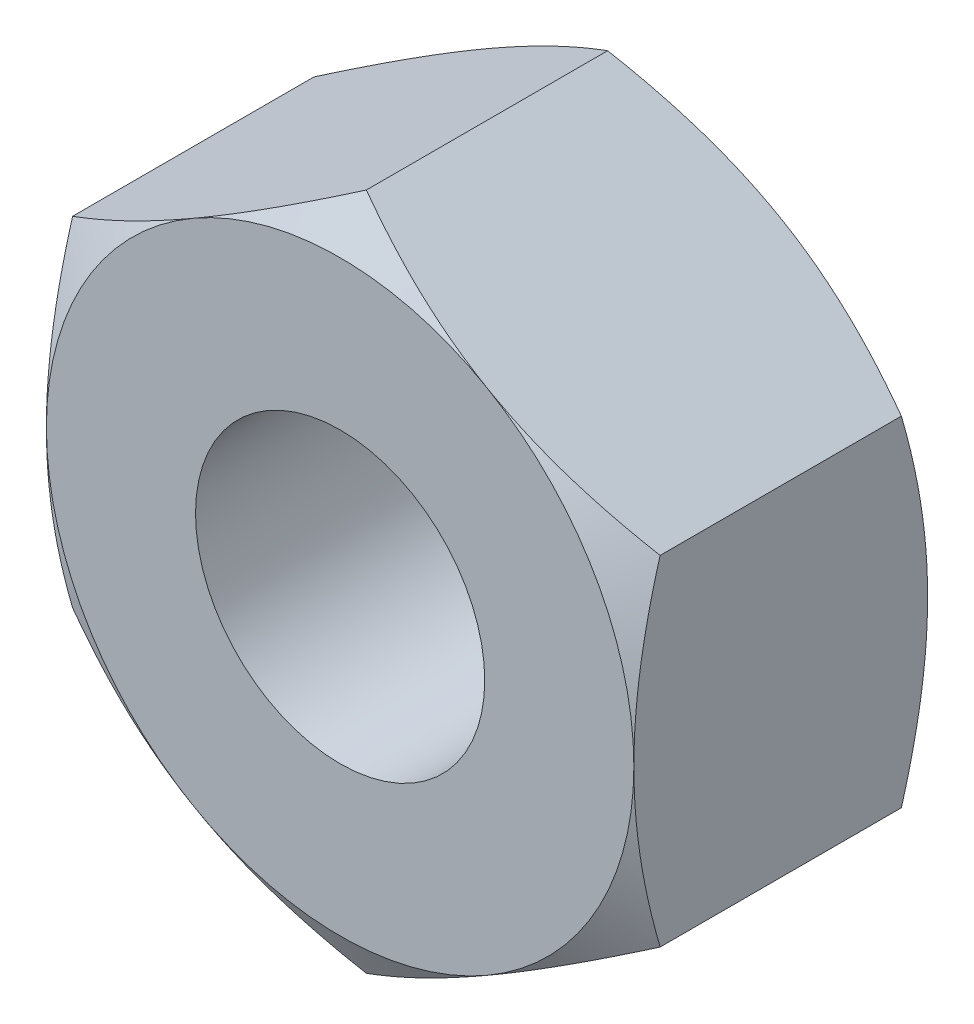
from build123d import *

# Parameters (mm, degrees)
BASE_EXTRUSION_DEPTH    = 6.5
ESQUISSE3_R             = 4
ENL_V_MAT_EXTRU_1_DEPTH = 12.867322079
ESQUISSE4_R             = 4
ESQUISSE4_R_2           = 3.2
BOSS_EXTRU_1_DEPTH      = 6.5


with BuildPart() as part:
    # Esquisse1 → Base-Extrusion (new body)
    with BuildSketch(Plane.XY):
        Polygon((6.5, -3.75277675), (6.5, 3.75277675), (0, 7.505553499), (-6.5, 3.75277675), (-6.5, -3.75277675), (0, -7.505553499), align=None)
    extrude(amount=-BASE_EXTRUSION_DEPTH)

    # Esquisse2 → Enl_vement de mati_re-R_volution1 (revolve, cut)
    with BuildSketch(Plane(origin=(0, 0, 0), x_dir=(1, 0, 0), z_dir=(0, 1, 0))):
        Polygon((-6.5, 0), (-13.129165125, 0), (-13.129165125, 6.5), (-6.5, 6.5), (-12.129165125, 3.25), align=None)
    revolve(axis=Axis((0, 0, -6.5), (0, 0, 1)), mode=Mode.SUBTRACT)

    # Esquisse3 → Enl_v. mat.-Extru.1 (cut, through all)
    with BuildSketch(Plane.XY):
        Circle(ESQUISSE3_R)
    extrude(amount=-ENL_V_MAT_EXTRU_1_DEPTH, mode=Mode.SUBTRACT)

    # Esquisse4 → Boss.-Extru.1 (add)
    with BuildSketch(Plane.XY):
        Circle(ESQUISSE4_R)
        Circle(ESQUISSE4_R_2, mode=Mode.SUBTRACT)
    extrude(amount=-BOSS_EXTRU_1_DEPTH)


solid = part.part
